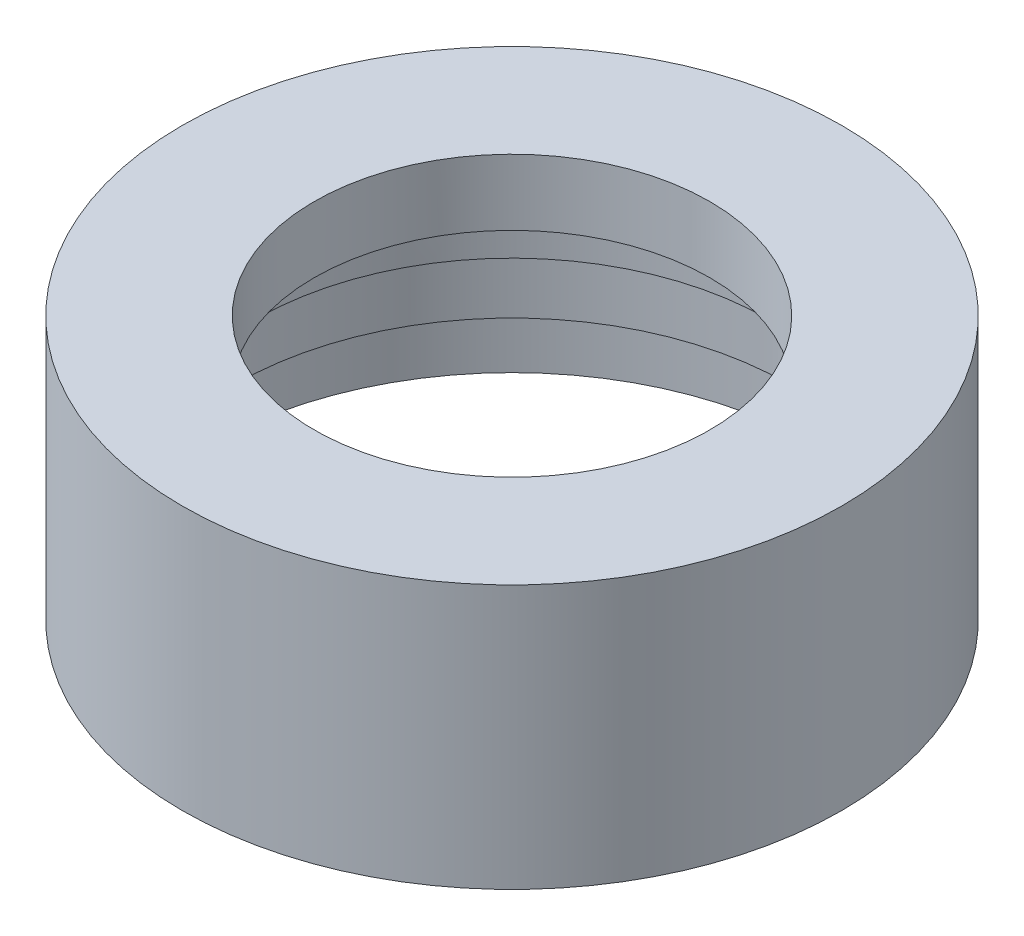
from build123d import *


with BuildPart() as part:
    # Sketch1 → Revolve1 (revolve)
    with BuildSketch(Plane.XY, mode=Mode.PRIVATE) as revolve1_sk:
        with BuildLine():
            Line((-132.453467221, 2.957667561), (-130.535289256, 2.957667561))
            Line((-130.535289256, 2.957667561), (-130.479142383, 8.482523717))
            Line((-130.479142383, 8.482523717), (-130.504137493, 8.478870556))
            Line((-130.504137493, 8.478870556), (-130.479137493, 8.483004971))
            ThreePointArc((-130.479137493, 8.483004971), (-127.660188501, 8.921940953), (-124.833467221, 9.307667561))
            Line((-124.833467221, 9.307667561), (-124.833467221, 15.657667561))
            Line((-124.833467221, 15.657667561), (-137.533467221, 15.657667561))
            Line((-137.533467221, 15.657667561), (-137.533467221, -9.742332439))
            Line((-137.533467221, -9.742332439), (-135.383636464, -9.742332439))
            Line((-135.383636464, -9.742332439), (-134.993467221, -9.742332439))
            Line((-134.993467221, -9.742332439), (-134.993467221, -3.411042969))
            Line((-134.993467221, -3.411042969), (-134.993467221, -3.392332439))
            Line((-134.993467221, -3.392332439), (-132.453467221, -3.392332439))
            Line((-132.453467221, -3.392332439), (-132.453467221, 2.957667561))
        make_face()
    revolve(revolve1_sk.sketch.rotate(Axis((-105.783467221, -11.879759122, 0), (0, 1, 0)), 270), axis=Axis((-105.783467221, -11.879759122, 0), (0, 1, 0)))


solid = part.part
